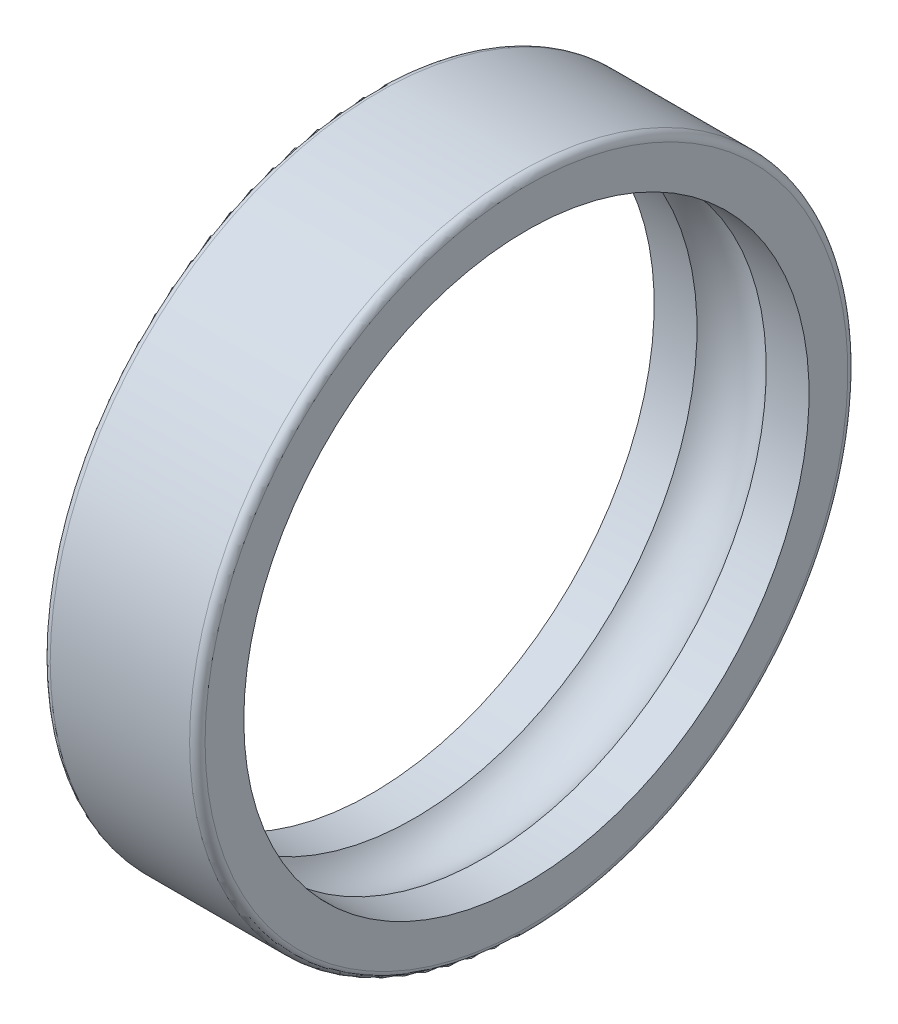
from build123d import *


with BuildPart() as part:
    # Esquisse1 → Base-R_volution (revolve)
    with BuildSketch(Plane(origin=(0, 0, 0), x_dir=(1, 0, 0), z_dir=(0, 1, 0)), mode=Mode.PRIVATE) as base_r_volution_sk:
        with BuildLine():
            Line((0, 8.3), (0, 7.3))
            Line((0, 7.3), (1.105572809, 7.3))
            ThreePointArc((1.105572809, 7.3), (2, 7.7), (2.894427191, 7.3))
            Line((2.894427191, 7.3), (4, 7.3))
            Line((4, 7.3), (4, 8.3))
            ThreePointArc((4, 8.3), (3.941421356, 8.441421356), (3.8, 8.5))
            Line((3.8, 8.5), (0.2, 8.5))
            ThreePointArc((0.2, 8.5), (0.058578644, 8.441421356), (0, 8.3))
        make_face()
    revolve(base_r_volution_sk.sketch.rotate(Axis((0, 0, 0), (1, 0, 0)), 180), axis=Axis((0, 0, 0), (1, 0, 0)))


solid = part.part
